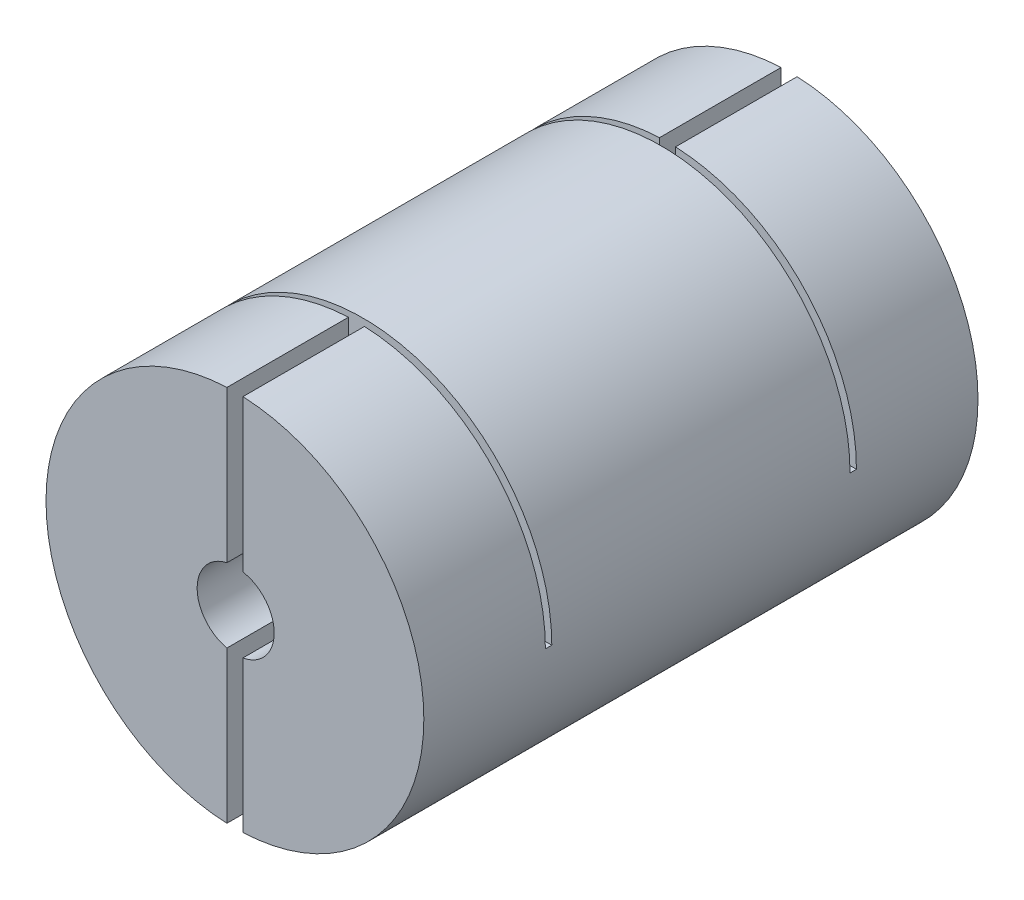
from build123d import *

# Parameters (mm, degrees)
SKETCH1_R                = 7.5
EXTRUDE1_DEPTH           = 11
SKETCH4_W                = 0.635
SKETCH4_H                = 7.20164609
CUT_EXTRUDE3_DEPTH       = 4.826
SKETCH5_W                = 0.635
SKETCH5_H                = 7.91295597
CUT_EXTRUDE4_DEPTH       = 2.413
SKETCH6_W                = 21.896269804
SKETCH6_H                = 0.254
CUT_EXTRUDE5_DEPTH       = 14.63675
F_3_0_3_DIAMETER_HOLE1_D = 3
SKETCH2_R                = 1.5
CUT_EXTRUDE1_DEPTH       = 16.28070679
SKETCH3_R                = 1.5
CUT_EXTRUDE2_DEPTH       = 16.28070679


with BuildPart() as part:
    # Sketch1 → Extrude1 (new body)
    with BuildSketch(Plane.XY):
        Circle(SKETCH1_R)
    extrude1 = extrude(amount=EXTRUDE1_DEPTH)

    # Sketch4 → Cut-Extrude3 (cut)
    with BuildSketch(Plane(origin=(0, 0, 11), x_dir=(-1, 0, 0), z_dir=(0, 0, -1))):
        with Locations((0, 4.415954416)):
            Rectangle(SKETCH4_W, SKETCH4_H)
    cut_extrude3 = extrude(amount=CUT_EXTRUDE3_DEPTH, mode=Mode.SUBTRACT)

    # Sketch5 → Cut-Extrude4 (cut)
    with BuildSketch(Plane(origin=(0, 0, 11), x_dir=(-1, 0, 0), z_dir=(0, 0, -1))):
        with Locations((0, -4.728256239)):
            Rectangle(SKETCH5_W, SKETCH5_H)
    cut_extrude4 = extrude(amount=CUT_EXTRUDE4_DEPTH, mode=Mode.SUBTRACT)

    # Sketch6 → Cut-Extrude5 (cut)
    with BuildSketch(Plane(origin=(0, 0, 0), x_dir=(1, 0, 0), z_dir=(0, 1, 0))):
        with Locations((-0.622328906, -6.047)):
            Rectangle(SKETCH6_W, SKETCH6_H)
    cut_extrude5 = extrude(amount=CUT_EXTRUDE5_DEPTH, mode=Mode.SUBTRACT)

    # Mirror1: Extrude1, Cut-Extrude3, Cut-Extrude4, Cut-Extrude5 across plane
    add(extrude1.mirror(Plane.XY))
    add(cut_extrude3.mirror(Plane.XY), mode=Mode.SUBTRACT)
    add(cut_extrude4.mirror(Plane.XY), mode=Mode.SUBTRACT)
    add(cut_extrude5.mirror(Plane.XY), mode=Mode.SUBTRACT)

    # 3.0 _3_ Diameter Hole1 (through all)
    with Locations(Plane.XY.offset(11)):
        with Locations((0.059351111, -0.012368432)):
            Hole(F_3_0_3_DIAMETER_HOLE1_D / 2)

    # Sketch2 → Cut-Extrude1 (cut, through all)
    with BuildSketch(Plane.XY):
        Circle(SKETCH2_R)
    extrude(amount=-CUT_EXTRUDE1_DEPTH, mode=Mode.SUBTRACT)

    # Sketch3 → Cut-Extrude2 (cut, through all)
    with BuildSketch(Plane.XY):
        Circle(SKETCH3_R)
    extrude(amount=CUT_EXTRUDE2_DEPTH, mode=Mode.SUBTRACT)


solid = part.part
